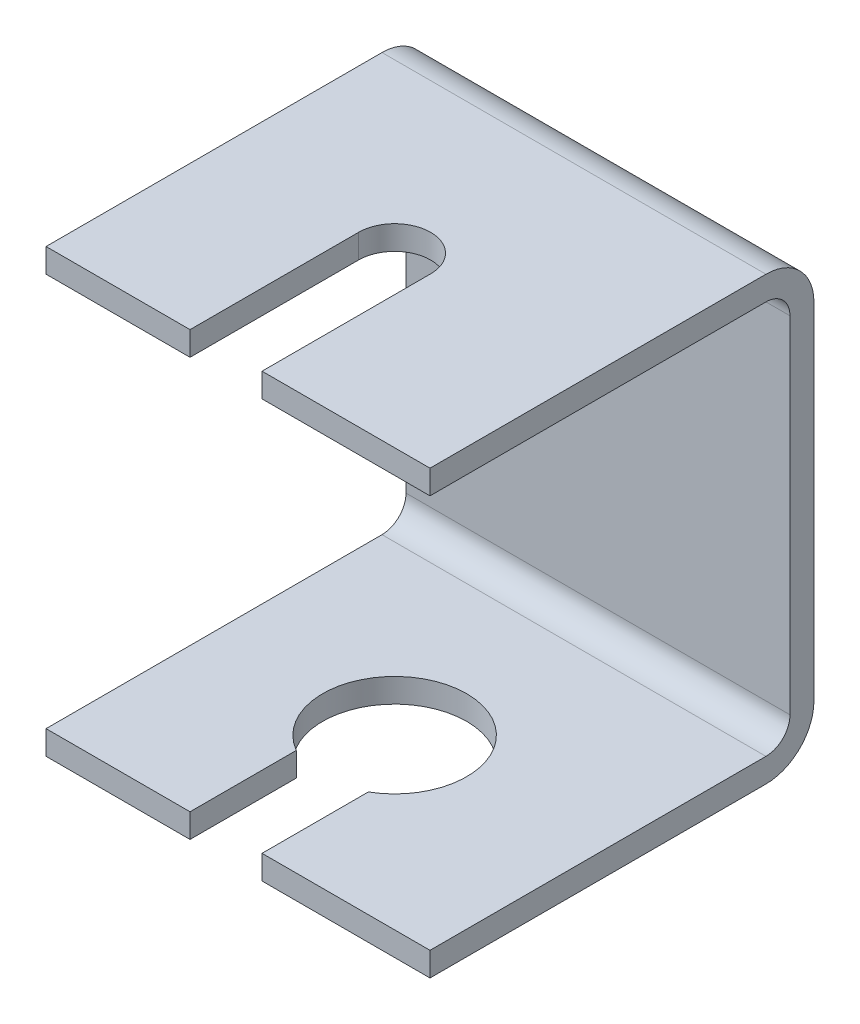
from build123d import *

# Parameters (mm, degrees)
BOSS_EXTRUDE1_DEPTH = 25.4
FILLET1_R           = 1.5875
FILLET2_R           = 3.175
CUT_EXTRUDE1_DEPTH  = 47.298424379
SKETCH4_R           = 4.7625
CUT_EXTRUDE2_DEPTH  = 25.4


with BuildPart() as part:
    # Sketch2 → Boss-Extrude1 (new body)
    with BuildSketch(Plane(origin=(0, 0, 0), x_dir=(0, 0, -1), z_dir=(1, 0, 0))):
        Polygon((0, 27.6225), (0, 29.21), (25.4, 29.21), (25.4, 0), (0, 0), (0, 1.5875), (23.8125, 1.5875), (23.8125, 27.6225), align=None)
    extrude(amount=BOSS_EXTRUDE1_DEPTH)

    # Fillet1
    fillet1_edges = [part.edges().sort_by_distance(p)[0] for p in [
        (12.7, 1.5875, -23.8125),
        (12.7, 27.6225, -23.8125),
    ]]
    fillet(fillet1_edges, radius=FILLET1_R)

    # Fillet2
    fillet2_edges = [part.edges().sort_by_distance(p)[0] for p in [
        (12.7, 29.21, -25.4),
        (12.7, 0, -25.4),
    ]]
    fillet(fillet2_edges, radius=FILLET2_R)

    # Sketch3 → Cut-Extrude1 (cut, through all)
    with BuildSketch(Plane(origin=(0, 29.21, 0), x_dir=(1, 0, 0), z_dir=(0, 1, 0))):
        with BuildLine():
            Line((9.525, 11.154198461), (9.525, -0.656660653))
            Line((9.525, -0.656660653), (14.2875, -0.656660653))
            Line((14.2875, -0.656660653), (14.2875, 11.154198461))
            ThreePointArc((14.2875, 11.154198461), (11.90625, 13.535448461), (9.525, 11.154198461))
        make_face()
    extrude(amount=-CUT_EXTRUDE1_DEPTH, mode=Mode.SUBTRACT)

    # Sketch4 → Cut-Extrude2 (cut)
    with BuildSketch(Plane.XZ):
        with Locations((11.90625, -11.154198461)):
            Circle(SKETCH4_R)
    extrude(amount=-CUT_EXTRUDE2_DEPTH, mode=Mode.SUBTRACT)


solid = part.part
